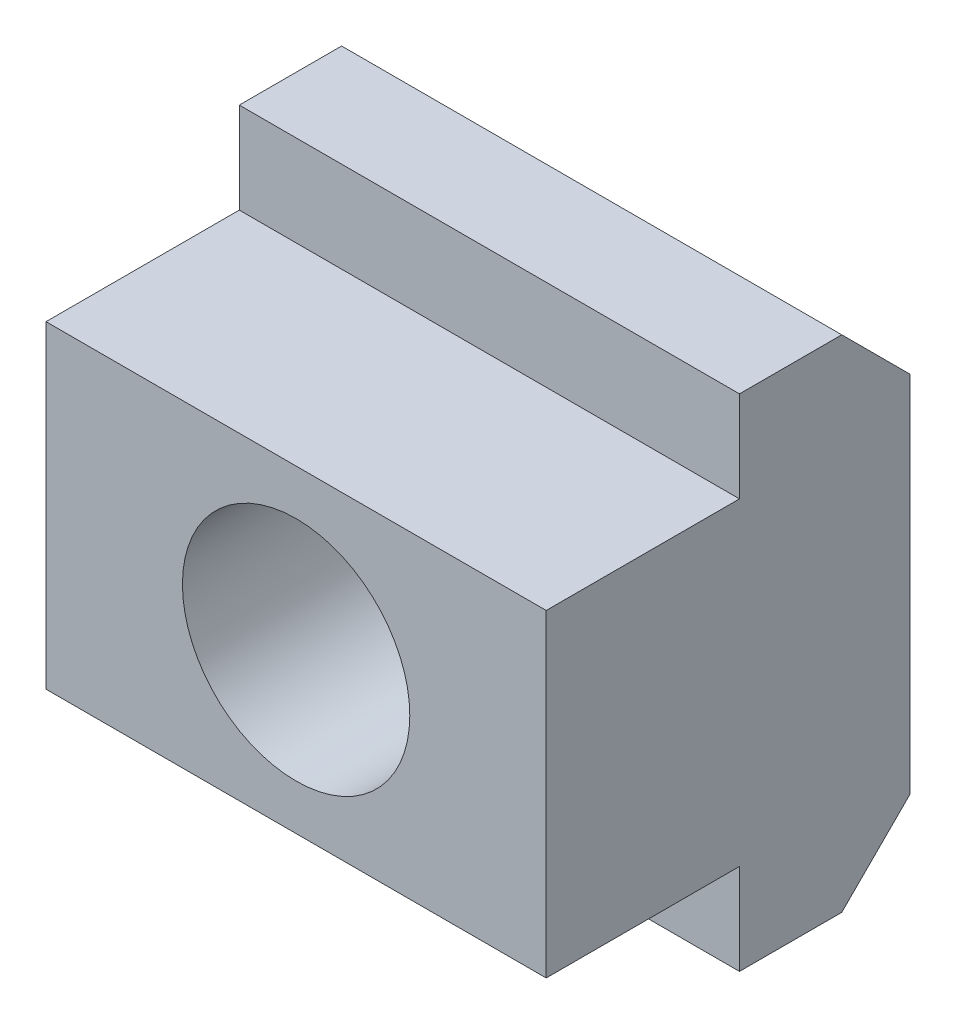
ISO-10303-21;
HEADER;
FILE_DESCRIPTION(('STEP AP214'),'2;1');
FILE_NAME('part.step','',(''),(''),'','','');
FILE_SCHEMA(('AUTOMOTIVE_DESIGN { 1 0 10303 214 1 1 1 1 }'));
ENDSEC;
DATA;
#1=APPLICATION_CONTEXT('core data for automotive mechanical design processes');
#2=APPLICATION_PROTOCOL_DEFINITION('international standard','automotive_design',2000,#1);
#3=PRODUCT_CONTEXT('',#1,'mechanical');
#4=PRODUCT('Part','Part','',(#3));
#5=PRODUCT_RELATED_PRODUCT_CATEGORY('part','',(#4));
#6=PRODUCT_DEFINITION_FORMATION('','',#4);
#7=PRODUCT_DEFINITION_CONTEXT('part definition',#1,'design');
#8=PRODUCT_DEFINITION('design','',#6,#7);
#9=PRODUCT_DEFINITION_SHAPE('','',#8);
#10=(LENGTH_UNIT() NAMED_UNIT(*) SI_UNIT(.MILLI.,.METRE.));
#11=(NAMED_UNIT(*) PLANE_ANGLE_UNIT() SI_UNIT($,.RADIAN.));
#12=(NAMED_UNIT(*) SI_UNIT($,.STERADIAN.) SOLID_ANGLE_UNIT());
#13=UNCERTAINTY_MEASURE_WITH_UNIT(LENGTH_MEASURE(1.E-05),#10,'distance_accuracy_value','');
#14=(GEOMETRIC_REPRESENTATION_CONTEXT(3) GLOBAL_UNCERTAINTY_ASSIGNED_CONTEXT((#13)) GLOBAL_UNIT_ASSIGNED_CONTEXT((#10,
#11,#12)) REPRESENTATION_CONTEXT('',''));
#15=CARTESIAN_POINT('',(0.,0.,0.));
#16=DIRECTION('',(0.,0.,1.));
#17=DIRECTION('',(1.,0.,0.));
#18=AXIS2_PLACEMENT_3D('',#15,#16,#17);
#19=CARTESIAN_POINT('',(-11.,-7.,8.5));
#20=DIRECTION('',(0.,1.,0.));
#21=DIRECTION('',(-1.,0.,0.));
#22=AXIS2_PLACEMENT_3D('',#19,#20,#21);
#23=PLANE('',#22);
#24=DIRECTION('',(0.,0.,1.));
#25=VECTOR('',#24,1.);
#26=CARTESIAN_POINT('',(11.,-7.,8.5));
#27=LINE('',#26,#25);
#28=CARTESIAN_POINT('',(11.,-7.,0.));
#29=VERTEX_POINT('',#28);
#30=CARTESIAN_POINT('',(11.,-7.,8.5));
#31=VERTEX_POINT('',#30);
#32=EDGE_CURVE('E101',#29,#31,#27,.T.);
#33=ORIENTED_EDGE('',*,*,#32,.T.);
#34=DIRECTION('',(1.,0.,0.));
#35=VECTOR('',#34,1.);
#36=CARTESIAN_POINT('',(-11.,-7.,8.5));
#37=LINE('',#36,#35);
#38=CARTESIAN_POINT('',(-11.,-7.,8.5));
#39=VERTEX_POINT('',#38);
#40=EDGE_CURVE('E109',#39,#31,#37,.T.);
#41=ORIENTED_EDGE('',*,*,#40,.F.);
#42=DIRECTION('',(0.,0.,1.));
#43=VECTOR('',#42,1.);
#44=CARTESIAN_POINT('',(-11.,-7.,8.5));
#45=LINE('',#44,#43);
#46=CARTESIAN_POINT('',(-11.,-7.,0.));
#47=VERTEX_POINT('',#46);
#48=EDGE_CURVE('E138',#47,#39,#45,.T.);
#49=ORIENTED_EDGE('',*,*,#48,.F.);
#50=DIRECTION('',(1.,0.,0.));
#51=VECTOR('',#50,1.);
#52=CARTESIAN_POINT('',(-11.,-7.,0.));
#53=LINE('',#52,#51);
#54=EDGE_CURVE('E120',#47,#29,#53,.T.);
#55=ORIENTED_EDGE('',*,*,#54,.T.);
#56=EDGE_LOOP('',(#33,#41,#49,#55));
#57=FACE_BOUND('',#56,.T.);
#58=ADVANCED_FACE('F17',(#57),#23,.F.);
#59=CARTESIAN_POINT('',(-11.,7.,8.5));
#60=DIRECTION('',(0.,0.,-1.));
#61=DIRECTION('',(1.,0.,0.));
#62=AXIS2_PLACEMENT_3D('',#59,#60,#61);
#63=PLANE('',#62);
#64=CARTESIAN_POINT('',(0.,0.,8.5));
#65=DIRECTION('',(0.,0.,1.));
#66=DIRECTION('',(-1.,0.,0.));
#67=AXIS2_PLACEMENT_3D('',#64,#65,#66);
#68=CIRCLE('',#67,5.);
#69=CARTESIAN_POINT('',(-5.,0.,8.5));
#70=VERTEX_POINT('',#69);
#71=EDGE_CURVE('E124',#70,#70,#68,.T.);
#72=ORIENTED_EDGE('',*,*,#71,.F.);
#73=EDGE_LOOP('',(#72));
#74=FACE_BOUND('',#73,.T.);
#75=DIRECTION('',(0.,1.,0.));
#76=VECTOR('',#75,1.);
#77=CARTESIAN_POINT('',(11.,7.,8.5));
#78=LINE('',#77,#76);
#79=CARTESIAN_POINT('',(11.,7.,8.5));
#80=VERTEX_POINT('',#79);
#81=EDGE_CURVE('E95',#31,#80,#78,.T.);
#82=ORIENTED_EDGE('',*,*,#81,.T.);
#83=DIRECTION('',(1.,0.,0.));
#84=VECTOR('',#83,1.);
#85=CARTESIAN_POINT('',(-11.,7.,8.5));
#86=LINE('',#85,#84);
#87=CARTESIAN_POINT('',(-11.,7.,8.5));
#88=VERTEX_POINT('',#87);
#89=EDGE_CURVE('E116',#88,#80,#86,.T.);
#90=ORIENTED_EDGE('',*,*,#89,.F.);
#91=DIRECTION('',(0.,1.,0.));
#92=VECTOR('',#91,1.);
#93=CARTESIAN_POINT('',(-11.,7.,8.5));
#94=LINE('',#93,#92);
#95=EDGE_CURVE('E111',#39,#88,#94,.T.);
#96=ORIENTED_EDGE('',*,*,#95,.F.);
#97=ORIENTED_EDGE('',*,*,#40,.T.);
#98=EDGE_LOOP('',(#82,#90,#96,#97));
#99=FACE_BOUND('',#98,.T.);
#100=ADVANCED_FACE('F110',(#74,#99),#63,.F.);
#101=CARTESIAN_POINT('',(-11.,7.,8.5));
#102=DIRECTION('',(0.,-1.,0.));
#103=DIRECTION('',(1.,0.,0.));
#104=AXIS2_PLACEMENT_3D('',#101,#102,#103);
#105=PLANE('',#104);
#106=DIRECTION('',(0.,0.,-1.));
#107=VECTOR('',#106,1.);
#108=CARTESIAN_POINT('',(11.,7.,8.5));
#109=LINE('',#108,#107);
#110=CARTESIAN_POINT('',(11.,7.,0.));
#111=VERTEX_POINT('',#110);
#112=EDGE_CURVE('E103',#80,#111,#109,.T.);
#113=ORIENTED_EDGE('',*,*,#112,.T.);
#114=DIRECTION('',(1.,0.,0.));
#115=VECTOR('',#114,1.);
#116=CARTESIAN_POINT('',(-11.,7.,0.));
#117=LINE('',#116,#115);
#118=CARTESIAN_POINT('',(-11.,7.,0.));
#119=VERTEX_POINT('',#118);
#120=EDGE_CURVE('E161',#119,#111,#117,.T.);
#121=ORIENTED_EDGE('',*,*,#120,.F.);
#122=DIRECTION('',(0.,0.,-1.));
#123=VECTOR('',#122,1.);
#124=CARTESIAN_POINT('',(-11.,7.,8.5));
#125=LINE('',#124,#123);
#126=EDGE_CURVE('E142',#88,#119,#125,.T.);
#127=ORIENTED_EDGE('',*,*,#126,.F.);
#128=ORIENTED_EDGE('',*,*,#89,.T.);
#129=EDGE_LOOP('',(#113,#121,#127,#128));
#130=FACE_BOUND('',#129,.T.);
#131=ADVANCED_FACE('F202',(#130),#105,.F.);
#132=CARTESIAN_POINT('',(-11.,7.,0.));
#133=DIRECTION('',(0.,0.,-1.));
#134=DIRECTION('',(0.,-1.,0.));
#135=AXIS2_PLACEMENT_3D('',#132,#133,#134);
#136=PLANE('',#135);
#137=DIRECTION('',(0.,1.,0.));
#138=VECTOR('',#137,1.);
#139=CARTESIAN_POINT('',(11.,7.,0.));
#140=LINE('',#139,#138);
#141=CARTESIAN_POINT('',(11.,11.,0.));
#142=VERTEX_POINT('',#141);
#143=EDGE_CURVE('E129',#111,#142,#140,.T.);
#144=ORIENTED_EDGE('',*,*,#143,.T.);
#145=DIRECTION('',(1.,0.,0.));
#146=VECTOR('',#145,1.);
#147=CARTESIAN_POINT('',(-11.,11.,0.));
#148=LINE('',#147,#146);
#149=CARTESIAN_POINT('',(-11.,11.,0.));
#150=VERTEX_POINT('',#149);
#151=EDGE_CURVE('E158',#150,#142,#148,.T.);
#152=ORIENTED_EDGE('',*,*,#151,.F.);
#153=DIRECTION('',(0.,1.,0.));
#154=VECTOR('',#153,1.);
#155=CARTESIAN_POINT('',(-11.,7.,0.));
#156=LINE('',#155,#154);
#157=EDGE_CURVE('E144',#119,#150,#156,.T.);
#158=ORIENTED_EDGE('',*,*,#157,.F.);
#159=ORIENTED_EDGE('',*,*,#120,.T.);
#160=EDGE_LOOP('',(#144,#152,#158,#159));
#161=FACE_BOUND('',#160,.T.);
#162=ADVANCED_FACE('F198',(#161),#136,.F.);
#163=CARTESIAN_POINT('',(-11.,11.,0.));
#164=DIRECTION('',(0.,-1.,0.));
#165=DIRECTION('',(1.,0.,0.));
#166=AXIS2_PLACEMENT_3D('',#163,#164,#165);
#167=PLANE('',#166);
#168=DIRECTION('',(0.,0.,-1.));
#169=VECTOR('',#168,1.);
#170=CARTESIAN_POINT('',(11.,11.,0.));
#171=LINE('',#170,#169);
#172=CARTESIAN_POINT('',(11.,11.,-4.5));
#173=VERTEX_POINT('',#172);
#174=EDGE_CURVE('E131',#142,#173,#171,.T.);
#175=ORIENTED_EDGE('',*,*,#174,.T.);
#176=DIRECTION('',(-1.,0.,0.));
#177=VECTOR('',#176,1.);
#178=CARTESIAN_POINT('',(-11.,11.,-4.5));
#179=LINE('',#178,#177);
#180=CARTESIAN_POINT('',(-11.,11.,-4.5));
#181=VERTEX_POINT('',#180);
#182=EDGE_CURVE('E10',#173,#181,#179,.T.);
#183=ORIENTED_EDGE('',*,*,#182,.T.);
#184=DIRECTION('',(0.,0.,-1.));
#185=VECTOR('',#184,1.);
#186=CARTESIAN_POINT('',(-11.,11.,0.));
#187=LINE('',#186,#185);
#188=EDGE_CURVE('E146',#150,#181,#187,.T.);
#189=ORIENTED_EDGE('',*,*,#188,.F.);
#190=ORIENTED_EDGE('',*,*,#151,.T.);
#191=EDGE_LOOP('',(#175,#183,#189,#190));
#192=FACE_BOUND('',#191,.T.);
#193=ADVANCED_FACE('F194',(#192),#167,.F.);
#194=CARTESIAN_POINT('',(-11.,11.,-7.5));
#195=DIRECTION('',(0.,0.,1.));
#196=DIRECTION('',(-1.,0.,0.));
#197=AXIS2_PLACEMENT_3D('',#194,#195,#196);
#198=PLANE('',#197);
#199=CARTESIAN_POINT('',(0.,0.,-7.5));
#200=DIRECTION('',(0.,0.,1.));
#201=DIRECTION('',(-1.,0.,0.));
#202=AXIS2_PLACEMENT_3D('',#199,#200,#201);
#203=CIRCLE('',#202,5.);
#204=CARTESIAN_POINT('',(-5.,0.,-7.5));
#205=VERTEX_POINT('',#204);
#206=EDGE_CURVE('E121',#205,#205,#203,.T.);
#207=ORIENTED_EDGE('',*,*,#206,.T.);
#208=EDGE_LOOP('',(#207));
#209=FACE_BOUND('',#208,.T.);
#210=DIRECTION('',(0.,-1.,0.));
#211=VECTOR('',#210,1.);
#212=CARTESIAN_POINT('',(11.,11.,-7.5));
#213=LINE('',#212,#211);
#214=CARTESIAN_POINT('',(11.,8.,-7.5));
#215=VERTEX_POINT('',#214);
#216=CARTESIAN_POINT('',(11.,-8.,-7.5));
#217=VERTEX_POINT('',#216);
#218=EDGE_CURVE('E133',#215,#217,#213,.T.);
#219=ORIENTED_EDGE('',*,*,#218,.T.);
#220=DIRECTION('',(-1.,0.,0.));
#221=VECTOR('',#220,1.);
#222=CARTESIAN_POINT('',(-11.,-8.,-7.5));
#223=LINE('',#222,#221);
#224=CARTESIAN_POINT('',(-11.,-8.,-7.5));
#225=VERTEX_POINT('',#224);
#226=EDGE_CURVE('E37',#217,#225,#223,.T.);
#227=ORIENTED_EDGE('',*,*,#226,.T.);
#228=DIRECTION('',(0.,-1.,0.));
#229=VECTOR('',#228,1.);
#230=CARTESIAN_POINT('',(-11.,11.,-7.5));
#231=LINE('',#230,#229);
#232=CARTESIAN_POINT('',(-11.,8.,-7.5));
#233=VERTEX_POINT('',#232);
#234=EDGE_CURVE('E148',#233,#225,#231,.T.);
#235=ORIENTED_EDGE('',*,*,#234,.F.);
#236=DIRECTION('',(1.,0.,0.));
#237=VECTOR('',#236,1.);
#238=CARTESIAN_POINT('',(-11.,8.,-7.5));
#239=LINE('',#238,#237);
#240=EDGE_CURVE('E171',#233,#215,#239,.T.);
#241=ORIENTED_EDGE('',*,*,#240,.T.);
#242=EDGE_LOOP('',(#219,#227,#235,#241));
#243=FACE_BOUND('',#242,.T.);
#244=ADVANCED_FACE('F188',(#209,#243),#198,.F.);
#245=CARTESIAN_POINT('',(-11.,-11.,0.));
#246=DIRECTION('',(0.,1.,0.));
#247=DIRECTION('',(-1.,0.,0.));
#248=AXIS2_PLACEMENT_3D('',#245,#246,#247);
#249=PLANE('',#248);
#250=DIRECTION('',(0.,0.,1.));
#251=VECTOR('',#250,1.);
#252=CARTESIAN_POINT('',(-11.,-11.,0.));
#253=LINE('',#252,#251);
#254=CARTESIAN_POINT('',(-11.,-11.,-4.5));
#255=VERTEX_POINT('',#254);
#256=CARTESIAN_POINT('',(-11.,-11.,0.));
#257=VERTEX_POINT('',#256);
#258=EDGE_CURVE('E150',#255,#257,#253,.T.);
#259=ORIENTED_EDGE('',*,*,#258,.F.);
#260=DIRECTION('',(1.,0.,0.));
#261=VECTOR('',#260,1.);
#262=CARTESIAN_POINT('',(-11.,-11.,-4.5));
#263=LINE('',#262,#261);
#264=CARTESIAN_POINT('',(11.,-11.,-4.5));
#265=VERTEX_POINT('',#264);
#266=EDGE_CURVE('E115',#255,#265,#263,.T.);
#267=ORIENTED_EDGE('',*,*,#266,.T.);
#268=DIRECTION('',(0.,0.,1.));
#269=VECTOR('',#268,1.);
#270=CARTESIAN_POINT('',(11.,-11.,0.));
#271=LINE('',#270,#269);
#272=CARTESIAN_POINT('',(11.,-11.,0.));
#273=VERTEX_POINT('',#272);
#274=EDGE_CURVE('E135',#265,#273,#271,.T.);
#275=ORIENTED_EDGE('',*,*,#274,.T.);
#276=DIRECTION('',(1.,0.,0.));
#277=VECTOR('',#276,1.);
#278=CARTESIAN_POINT('',(-11.,-11.,0.));
#279=LINE('',#278,#277);
#280=EDGE_CURVE('E155',#257,#273,#279,.T.);
#281=ORIENTED_EDGE('',*,*,#280,.F.);
#282=EDGE_LOOP('',(#259,#267,#275,#281));
#283=FACE_BOUND('',#282,.T.);
#284=ADVANCED_FACE('F184',(#283),#249,.F.);
#285=CARTESIAN_POINT('',(-11.,-7.,0.));
#286=DIRECTION('',(0.,0.,-1.));
#287=DIRECTION('',(0.,-1.,0.));
#288=AXIS2_PLACEMENT_3D('',#285,#286,#287);
#289=PLANE('',#288);
#290=DIRECTION('',(0.,1.,0.));
#291=VECTOR('',#290,1.);
#292=CARTESIAN_POINT('',(11.,-7.,0.));
#293=LINE('',#292,#291);
#294=EDGE_CURVE('E137',#273,#29,#293,.T.);
#295=ORIENTED_EDGE('',*,*,#294,.T.);
#296=ORIENTED_EDGE('',*,*,#54,.F.);
#297=DIRECTION('',(0.,1.,0.));
#298=VECTOR('',#297,1.);
#299=CARTESIAN_POINT('',(-11.,-7.,0.));
#300=LINE('',#299,#298);
#301=EDGE_CURVE('E152',#257,#47,#300,.T.);
#302=ORIENTED_EDGE('',*,*,#301,.F.);
#303=ORIENTED_EDGE('',*,*,#280,.T.);
#304=EDGE_LOOP('',(#295,#296,#302,#303));
#305=FACE_BOUND('',#304,.T.);
#306=ADVANCED_FACE('F204',(#305),#289,.F.);
#307=CARTESIAN_POINT('',(-11.,-7.,-7.5));
#308=DIRECTION('',(-1.,0.,0.));
#309=DIRECTION('',(0.,-1.,0.));
#310=AXIS2_PLACEMENT_3D('',#307,#308,#309);
#311=PLANE('',#310);
#312=ORIENTED_EDGE('',*,*,#234,.T.);
#313=DIRECTION('',(0.,0.707106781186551,-0.707106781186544));
#314=VECTOR('',#313,1.);
#315=CARTESIAN_POINT('',(-11.,-7.5,-8.));
#316=LINE('',#315,#314);
#317=EDGE_CURVE('E24',#225,#255,#316,.F.);
#318=ORIENTED_EDGE('',*,*,#317,.T.);
#319=ORIENTED_EDGE('',*,*,#258,.T.);
#320=ORIENTED_EDGE('',*,*,#301,.T.);
#321=ORIENTED_EDGE('',*,*,#48,.T.);
#322=ORIENTED_EDGE('',*,*,#95,.T.);
#323=ORIENTED_EDGE('',*,*,#126,.T.);
#324=ORIENTED_EDGE('',*,*,#157,.T.);
#325=ORIENTED_EDGE('',*,*,#188,.T.);
#326=DIRECTION('',(0.,0.707106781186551,0.707106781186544));
#327=VECTOR('',#326,1.);
#328=CARTESIAN_POINT('',(-11.,0.499999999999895,-15.));
#329=LINE('',#328,#327);
#330=EDGE_CURVE('E175',#181,#233,#329,.F.);
#331=ORIENTED_EDGE('',*,*,#330,.T.);
#332=EDGE_LOOP('',(#312,#318,#319,#320,#321,#322,#323,#324,#325,#331));
#333=FACE_BOUND('',#332,.T.);
#334=ADVANCED_FACE('F179',(#333),#311,.T.);
#335=CARTESIAN_POINT('',(11.,-7.,-7.5));
#336=DIRECTION('',(-1.,0.,0.));
#337=DIRECTION('',(0.,-1.,0.));
#338=AXIS2_PLACEMENT_3D('',#335,#336,#337);
#339=PLANE('',#338);
#340=ORIENTED_EDGE('',*,*,#274,.F.);
#341=DIRECTION('',(0.,-0.707106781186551,0.707106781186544));
#342=VECTOR('',#341,1.);
#343=CARTESIAN_POINT('',(11.,-11.,-4.5));
#344=LINE('',#343,#342);
#345=EDGE_CURVE('E169',#265,#217,#344,.F.);
#346=ORIENTED_EDGE('',*,*,#345,.T.);
#347=ORIENTED_EDGE('',*,*,#218,.F.);
#348=DIRECTION('',(0.,-0.707106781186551,-0.707106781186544));
#349=VECTOR('',#348,1.);
#350=CARTESIAN_POINT('',(11.,8.,-7.5));
#351=LINE('',#350,#349);
#352=EDGE_CURVE('E167',#215,#173,#351,.F.);
#353=ORIENTED_EDGE('',*,*,#352,.T.);
#354=ORIENTED_EDGE('',*,*,#174,.F.);
#355=ORIENTED_EDGE('',*,*,#143,.F.);
#356=ORIENTED_EDGE('',*,*,#112,.F.);
#357=ORIENTED_EDGE('',*,*,#81,.F.);
#358=ORIENTED_EDGE('',*,*,#32,.F.);
#359=ORIENTED_EDGE('',*,*,#294,.F.);
#360=EDGE_LOOP('',(#340,#346,#347,#353,#354,#355,#356,#357,#358,#359));
#361=FACE_BOUND('',#360,.T.);
#362=ADVANCED_FACE('F98',(#361),#339,.F.);
#363=CARTESIAN_POINT('',(-11.,-11.,-4.5));
#364=DIRECTION('',(0.,0.707106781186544,0.707106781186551));
#365=DIRECTION('',(0.,0.707106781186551,-0.707106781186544));
#366=AXIS2_PLACEMENT_3D('',#363,#364,#365);
#367=PLANE('',#366);
#368=ORIENTED_EDGE('',*,*,#317,.F.);
#369=ORIENTED_EDGE('',*,*,#226,.F.);
#370=ORIENTED_EDGE('',*,*,#345,.F.);
#371=ORIENTED_EDGE('',*,*,#266,.F.);
#372=EDGE_LOOP('',(#368,#369,#370,#371));
#373=FACE_BOUND('',#372,.T.);
#374=ADVANCED_FACE('F186',(#373),#367,.F.);
#375=CARTESIAN_POINT('',(-11.,8.,-7.5));
#376=DIRECTION('',(0.,-0.707106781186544,0.707106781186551));
#377=DIRECTION('',(0.,0.707106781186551,0.707106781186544));
#378=AXIS2_PLACEMENT_3D('',#375,#376,#377);
#379=PLANE('',#378);
#380=ORIENTED_EDGE('',*,*,#330,.F.);
#381=ORIENTED_EDGE('',*,*,#182,.F.);
#382=ORIENTED_EDGE('',*,*,#352,.F.);
#383=ORIENTED_EDGE('',*,*,#240,.F.);
#384=EDGE_LOOP('',(#380,#381,#382,#383));
#385=FACE_BOUND('',#384,.T.);
#386=ADVANCED_FACE('F192',(#385),#379,.F.);
#387=CARTESIAN_POINT('',(0.,0.,-7.5));
#388=DIRECTION('',(0.,0.,1.));
#389=DIRECTION('',(-1.,0.,0.));
#390=AXIS2_PLACEMENT_3D('',#387,#388,#389);
#391=CYLINDRICAL_SURFACE('',#390,5.);
#392=ORIENTED_EDGE('',*,*,#206,.F.);
#393=EDGE_LOOP('',(#392));
#394=FACE_BOUND('',#393,.T.);
#395=ORIENTED_EDGE('',*,*,#71,.T.);
#396=EDGE_LOOP('',(#395));
#397=FACE_BOUND('',#396,.T.);
#398=ADVANCED_FACE('F239',(#394,#397),#391,.F.);
#399=CLOSED_SHELL('',(#58,#100,#131,#162,#193,#244,#284,#306,#334,#362,#374,#386,#398));
#400=MANIFOLD_SOLID_BREP('B1',#399);
#401=ADVANCED_BREP_SHAPE_REPRESENTATION('',(#18,#400),#14);
#402=SHAPE_DEFINITION_REPRESENTATION(#9,#401);
ENDSEC;
END-ISO-10303-21;
